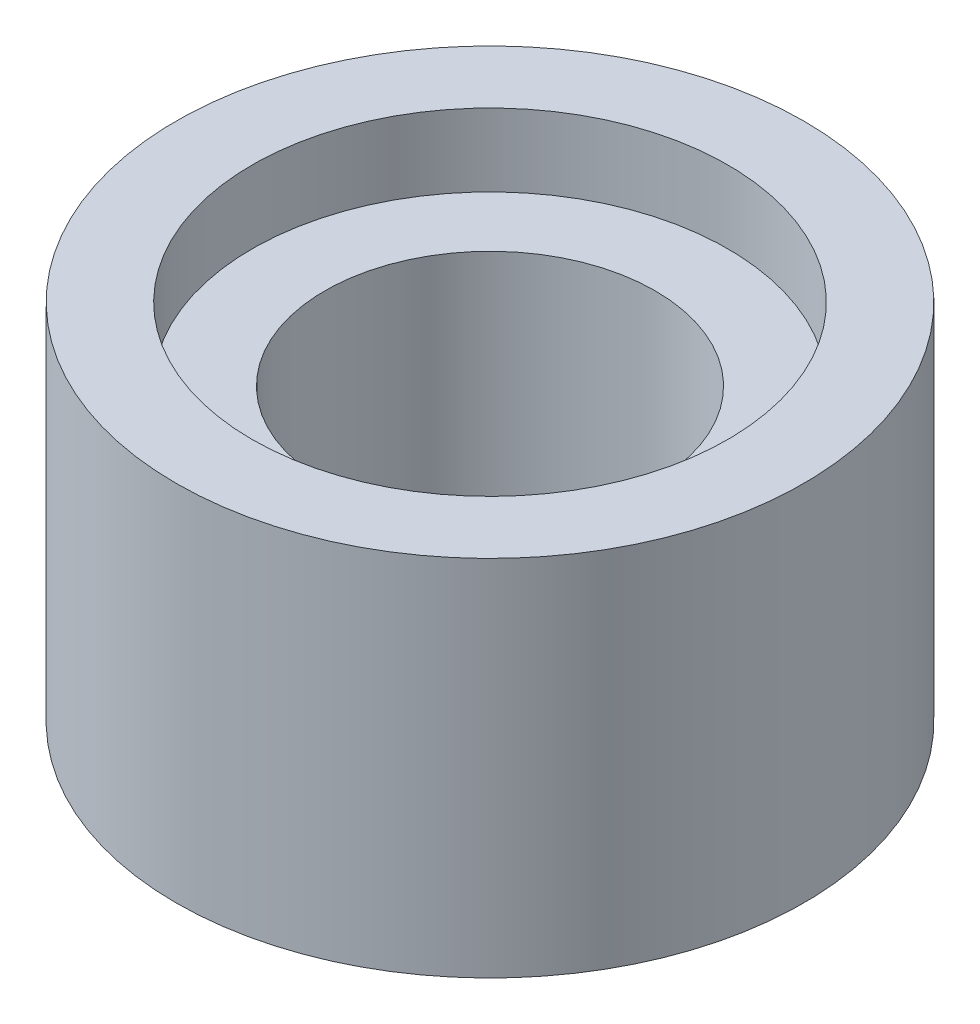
from build123d import *


with BuildPart() as part:
    # Esquisse1 → Base-R_volution (revolve)
    with BuildSketch(Plane(origin=(0, 0, 0), x_dir=(0, -1, 0), z_dir=(1, 0, 0)), mode=Mode.PRIVATE) as base_r_volution_sk:
        Polygon((0, 7.334147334), (0, 9.634147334), (11, 9.634147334), (11, 7.334147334), (8.8, 7.334147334), (8.8, 5.134147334), (2.2, 5.134147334), (2.2, 7.334147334), align=None)
    revolve(base_r_volution_sk.sketch.rotate(Axis((0, 12.574722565, -0.134147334), (0, -1, 0)), 180), axis=Axis((0, 12.574722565, -0.134147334), (0, -1, 0)))


solid = part.part
